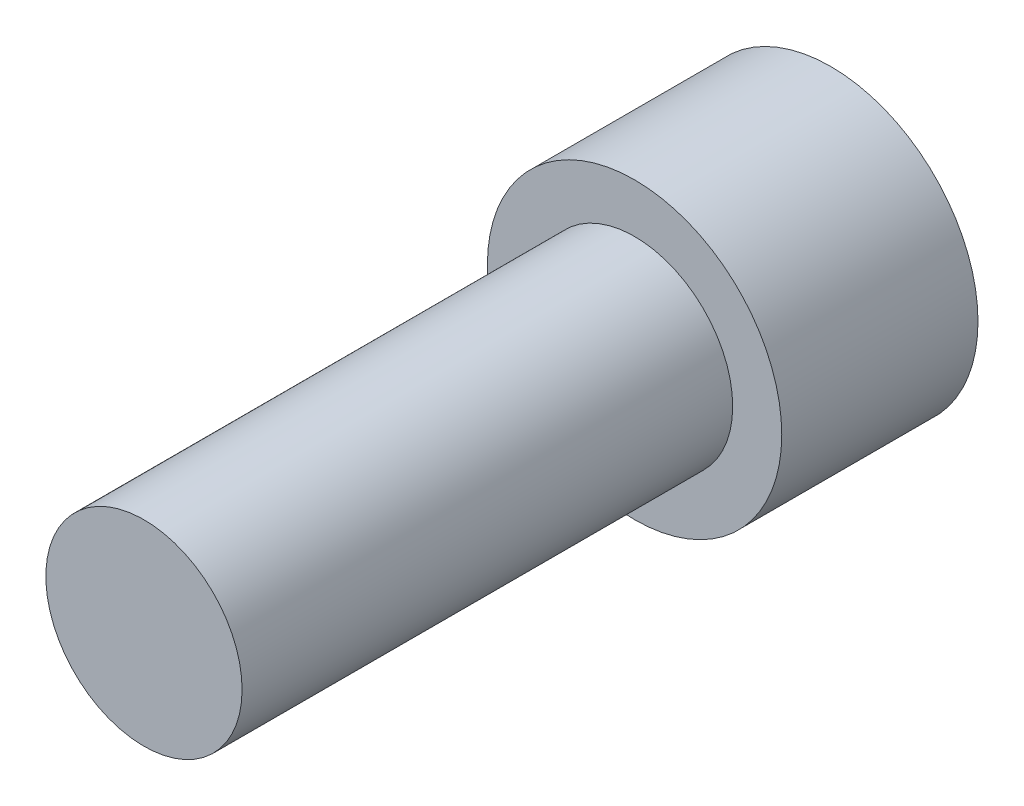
ISO-10303-21;
HEADER;
FILE_DESCRIPTION(('STEP AP214'),'2;1');
FILE_NAME('part.step','',(''),(''),'','','');
FILE_SCHEMA(('AUTOMOTIVE_DESIGN { 1 0 10303 214 1 1 1 1 }'));
ENDSEC;
DATA;
#1=APPLICATION_CONTEXT('core data for automotive mechanical design processes');
#2=APPLICATION_PROTOCOL_DEFINITION('international standard','automotive_design',2000,#1);
#3=PRODUCT_CONTEXT('',#1,'mechanical');
#4=PRODUCT('Part','Part','',(#3));
#5=PRODUCT_RELATED_PRODUCT_CATEGORY('part','',(#4));
#6=PRODUCT_DEFINITION_FORMATION('','',#4);
#7=PRODUCT_DEFINITION_CONTEXT('part definition',#1,'design');
#8=PRODUCT_DEFINITION('design','',#6,#7);
#9=PRODUCT_DEFINITION_SHAPE('','',#8);
#10=(LENGTH_UNIT() NAMED_UNIT(*) SI_UNIT(.MILLI.,.METRE.));
#11=(NAMED_UNIT(*) PLANE_ANGLE_UNIT() SI_UNIT($,.RADIAN.));
#12=(NAMED_UNIT(*) SI_UNIT($,.STERADIAN.) SOLID_ANGLE_UNIT());
#13=UNCERTAINTY_MEASURE_WITH_UNIT(LENGTH_MEASURE(1.E-05),#10,'distance_accuracy_value','');
#14=(GEOMETRIC_REPRESENTATION_CONTEXT(3) GLOBAL_UNCERTAINTY_ASSIGNED_CONTEXT((#13)) GLOBAL_UNIT_ASSIGNED_CONTEXT((#10,
#11,#12)) REPRESENTATION_CONTEXT('',''));
#15=CARTESIAN_POINT('',(0.,0.,0.));
#16=DIRECTION('',(0.,0.,1.));
#17=DIRECTION('',(1.,0.,0.));
#18=AXIS2_PLACEMENT_3D('',#15,#16,#17);
#19=CARTESIAN_POINT('',(0.,-9.525,-12.7));
#20=DIRECTION('',(0.,0.,-1.));
#21=DIRECTION('',(-1.,0.,0.));
#22=AXIS2_PLACEMENT_3D('',#19,#20,#21);
#23=PLANE('',#22);
#24=DIRECTION('',(0.866025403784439,-0.5,0.));
#25=VECTOR('',#24,1.);
#26=CARTESIAN_POINT('',(0.,5.49926131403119,-12.7));
#27=LINE('',#26,#25);
#28=CARTESIAN_POINT('',(0.,5.49926131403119,-12.7));
#29=VERTEX_POINT('',#28);
#30=CARTESIAN_POINT('',(4.7625,2.74963065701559,-12.7));
#31=VERTEX_POINT('',#30);
#32=EDGE_CURVE('E46',#29,#31,#27,.T.);
#33=ORIENTED_EDGE('',*,*,#32,.F.);
#34=DIRECTION('',(0.866025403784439,0.5,0.));
#35=VECTOR('',#34,1.);
#36=CARTESIAN_POINT('',(-4.7625,2.74963065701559,-12.7));
#37=LINE('',#36,#35);
#38=CARTESIAN_POINT('',(-4.7625,2.74963065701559,-12.7));
#39=VERTEX_POINT('',#38);
#40=EDGE_CURVE('E129',#39,#29,#37,.T.);
#41=ORIENTED_EDGE('',*,*,#40,.F.);
#42=DIRECTION('',(0.,1.,0.));
#43=VECTOR('',#42,1.);
#44=CARTESIAN_POINT('',(-4.7625,-2.74963065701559,-12.7));
#45=LINE('',#44,#43);
#46=CARTESIAN_POINT('',(-4.7625,-2.74963065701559,-12.7));
#47=VERTEX_POINT('',#46);
#48=EDGE_CURVE('E127',#47,#39,#45,.T.);
#49=ORIENTED_EDGE('',*,*,#48,.F.);
#50=DIRECTION('',(-0.866025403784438,0.5,0.));
#51=VECTOR('',#50,1.);
#52=CARTESIAN_POINT('',(0.,-5.49926131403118,-12.7));
#53=LINE('',#52,#51);
#54=CARTESIAN_POINT('',(0.,-5.49926131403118,-12.7));
#55=VERTEX_POINT('',#54);
#56=EDGE_CURVE('E94',#55,#47,#53,.T.);
#57=ORIENTED_EDGE('',*,*,#56,.F.);
#58=DIRECTION('',(-0.866025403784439,-0.5,0.));
#59=VECTOR('',#58,1.);
#60=CARTESIAN_POINT('',(4.7625,-2.74963065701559,-12.7));
#61=LINE('',#60,#59);
#62=CARTESIAN_POINT('',(4.7625,-2.74963065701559,-12.7));
#63=VERTEX_POINT('',#62);
#64=EDGE_CURVE('E123',#63,#55,#61,.T.);
#65=ORIENTED_EDGE('',*,*,#64,.F.);
#66=DIRECTION('',(0.,-1.,0.));
#67=VECTOR('',#66,1.);
#68=CARTESIAN_POINT('',(4.7625,2.74963065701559,-12.7));
#69=LINE('',#68,#67);
#70=EDGE_CURVE('E120',#31,#63,#69,.T.);
#71=ORIENTED_EDGE('',*,*,#70,.F.);
#72=EDGE_LOOP('',(#33,#41,#49,#57,#65,#71));
#73=FACE_BOUND('',#72,.T.);
#74=CARTESIAN_POINT('',(0.,0.,-12.7));
#75=DIRECTION('',(0.,0.,1.));
#76=DIRECTION('',(1.,0.,0.));
#77=AXIS2_PLACEMENT_3D('',#74,#75,#76);
#78=CIRCLE('',#77,9.525);
#79=CARTESIAN_POINT('',(9.525,0.,-12.7));
#80=VERTEX_POINT('',#79);
#81=EDGE_CURVE('E11',#80,#80,#78,.T.);
#82=ORIENTED_EDGE('',*,*,#81,.F.);
#83=EDGE_LOOP('',(#82));
#84=FACE_BOUND('',#83,.T.);
#85=ADVANCED_FACE('F32',(#73,#84),#23,.T.);
#86=CARTESIAN_POINT('',(0.,0.,31.75));
#87=DIRECTION('',(0.,0.,1.));
#88=DIRECTION('',(1.,0.,0.));
#89=AXIS2_PLACEMENT_3D('',#86,#87,#88);
#90=CYLINDRICAL_SURFACE('',#89,9.525);
#91=ORIENTED_EDGE('',*,*,#81,.T.);
#92=EDGE_LOOP('',(#91));
#93=FACE_BOUND('',#92,.T.);
#94=CARTESIAN_POINT('',(0.,0.,0.));
#95=DIRECTION('',(0.,0.,1.));
#96=DIRECTION('',(1.,0.,0.));
#97=AXIS2_PLACEMENT_3D('',#94,#95,#96);
#98=CIRCLE('',#97,9.525);
#99=CARTESIAN_POINT('',(9.525,0.,0.));
#100=VERTEX_POINT('',#99);
#101=EDGE_CURVE('E39',#100,#100,#98,.T.);
#102=ORIENTED_EDGE('',*,*,#101,.F.);
#103=EDGE_LOOP('',(#102));
#104=FACE_BOUND('',#103,.T.);
#105=ADVANCED_FACE('F149',(#93,#104),#90,.T.);
#106=CARTESIAN_POINT('',(0.,-6.35,0.));
#107=DIRECTION('',(0.,0.,1.));
#108=DIRECTION('',(1.,0.,0.));
#109=AXIS2_PLACEMENT_3D('',#106,#107,#108);
#110=PLANE('',#109);
#111=ORIENTED_EDGE('',*,*,#101,.T.);
#112=EDGE_LOOP('',(#111));
#113=FACE_BOUND('',#112,.T.);
#114=CARTESIAN_POINT('',(0.,0.,0.));
#115=DIRECTION('',(0.,0.,1.));
#116=DIRECTION('',(1.,0.,0.));
#117=AXIS2_PLACEMENT_3D('',#114,#115,#116);
#118=CIRCLE('',#117,6.35);
#119=CARTESIAN_POINT('',(6.35,0.,0.));
#120=VERTEX_POINT('',#119);
#121=EDGE_CURVE('E141',#120,#120,#118,.T.);
#122=ORIENTED_EDGE('',*,*,#121,.F.);
#123=EDGE_LOOP('',(#122));
#124=FACE_BOUND('',#123,.T.);
#125=ADVANCED_FACE('F146',(#113,#124),#110,.T.);
#126=CARTESIAN_POINT('',(0.,0.,31.75));
#127=DIRECTION('',(0.,0.,1.));
#128=DIRECTION('',(1.,0.,0.));
#129=AXIS2_PLACEMENT_3D('',#126,#127,#128);
#130=CYLINDRICAL_SURFACE('',#129,6.35);
#131=ORIENTED_EDGE('',*,*,#121,.T.);
#132=EDGE_LOOP('',(#131));
#133=FACE_BOUND('',#132,.T.);
#134=CARTESIAN_POINT('',(0.,0.,31.75));
#135=DIRECTION('',(0.,0.,1.));
#136=DIRECTION('',(1.,0.,0.));
#137=AXIS2_PLACEMENT_3D('',#134,#135,#136);
#138=CIRCLE('',#137,6.35);
#139=CARTESIAN_POINT('',(6.35,0.,31.75));
#140=VERTEX_POINT('',#139);
#141=EDGE_CURVE('E133',#140,#140,#138,.T.);
#142=ORIENTED_EDGE('',*,*,#141,.F.);
#143=EDGE_LOOP('',(#142));
#144=FACE_BOUND('',#143,.T.);
#145=ADVANCED_FACE('F156',(#133,#144),#130,.T.);
#146=CARTESIAN_POINT('',(0.,0.,31.75));
#147=DIRECTION('',(0.,0.,1.));
#148=DIRECTION('',(1.,0.,0.));
#149=AXIS2_PLACEMENT_3D('',#146,#147,#148);
#150=PLANE('',#149);
#151=ORIENTED_EDGE('',*,*,#141,.T.);
#152=EDGE_LOOP('',(#151));
#153=FACE_BOUND('',#152,.T.);
#154=ADVANCED_FACE('F162',(#153),#150,.T.);
#155=CARTESIAN_POINT('',(0.,5.49926131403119,-5.588));
#156=DIRECTION('',(0.5,0.866025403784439,0.));
#157=DIRECTION('',(-0.866025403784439,0.5,0.));
#158=AXIS2_PLACEMENT_3D('',#155,#156,#157);
#159=PLANE('',#158);
#160=ORIENTED_EDGE('',*,*,#32,.T.);
#161=DIRECTION('',(0.,0.,-1.));
#162=VECTOR('',#161,1.);
#163=CARTESIAN_POINT('',(4.7625,2.74963065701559,-5.588));
#164=LINE('',#163,#162);
#165=CARTESIAN_POINT('',(4.7625,2.74963065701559,-5.588));
#166=VERTEX_POINT('',#165);
#167=EDGE_CURVE('E76',#166,#31,#164,.T.);
#168=ORIENTED_EDGE('',*,*,#167,.F.);
#169=DIRECTION('',(0.866025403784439,-0.5,0.));
#170=VECTOR('',#169,1.);
#171=CARTESIAN_POINT('',(0.,5.49926131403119,-5.588));
#172=LINE('',#171,#170);
#173=CARTESIAN_POINT('',(0.,5.49926131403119,-5.588));
#174=VERTEX_POINT('',#173);
#175=EDGE_CURVE('E131',#174,#166,#172,.T.);
#176=ORIENTED_EDGE('',*,*,#175,.F.);
#177=DIRECTION('',(0.,0.,-1.));
#178=VECTOR('',#177,1.);
#179=CARTESIAN_POINT('',(0.,5.49926131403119,-5.588));
#180=LINE('',#179,#178);
#181=EDGE_CURVE('E54',#174,#29,#180,.T.);
#182=ORIENTED_EDGE('',*,*,#181,.T.);
#183=EDGE_LOOP('',(#160,#168,#176,#182));
#184=FACE_BOUND('',#183,.T.);
#185=ADVANCED_FACE('F166',(#184),#159,.F.);
#186=CARTESIAN_POINT('',(-4.7625,2.74963065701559,-5.588));
#187=DIRECTION('',(-0.5,0.866025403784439,0.));
#188=DIRECTION('',(-0.866025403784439,-0.5,0.));
#189=AXIS2_PLACEMENT_3D('',#186,#187,#188);
#190=PLANE('',#189);
#191=ORIENTED_EDGE('',*,*,#40,.T.);
#192=ORIENTED_EDGE('',*,*,#181,.F.);
#193=DIRECTION('',(0.866025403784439,0.5,0.));
#194=VECTOR('',#193,1.);
#195=CARTESIAN_POINT('',(-4.7625,2.74963065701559,-5.588));
#196=LINE('',#195,#194);
#197=CARTESIAN_POINT('',(-4.7625,2.74963065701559,-5.588));
#198=VERTEX_POINT('',#197);
#199=EDGE_CURVE('E106',#198,#174,#196,.T.);
#200=ORIENTED_EDGE('',*,*,#199,.F.);
#201=DIRECTION('',(0.,0.,-1.));
#202=VECTOR('',#201,1.);
#203=CARTESIAN_POINT('',(-4.7625,2.74963065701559,-5.588));
#204=LINE('',#203,#202);
#205=EDGE_CURVE('E98',#198,#39,#204,.T.);
#206=ORIENTED_EDGE('',*,*,#205,.T.);
#207=EDGE_LOOP('',(#191,#192,#200,#206));
#208=FACE_BOUND('',#207,.T.);
#209=ADVANCED_FACE('F170',(#208),#190,.F.);
#210=CARTESIAN_POINT('',(-4.7625,-2.74963065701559,-5.588));
#211=DIRECTION('',(-1.,0.,0.));
#212=DIRECTION('',(0.,-1.,0.));
#213=AXIS2_PLACEMENT_3D('',#210,#211,#212);
#214=PLANE('',#213);
#215=ORIENTED_EDGE('',*,*,#48,.T.);
#216=ORIENTED_EDGE('',*,*,#205,.F.);
#217=DIRECTION('',(0.,1.,0.));
#218=VECTOR('',#217,1.);
#219=CARTESIAN_POINT('',(-4.7625,-2.74963065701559,-5.588));
#220=LINE('',#219,#218);
#221=CARTESIAN_POINT('',(-4.7625,-2.74963065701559,-5.588));
#222=VERTEX_POINT('',#221);
#223=EDGE_CURVE('E102',#222,#198,#220,.T.);
#224=ORIENTED_EDGE('',*,*,#223,.F.);
#225=DIRECTION('',(0.,0.,-1.));
#226=VECTOR('',#225,1.);
#227=CARTESIAN_POINT('',(-4.7625,-2.74963065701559,-5.588));
#228=LINE('',#227,#226);
#229=EDGE_CURVE('E87',#222,#47,#228,.T.);
#230=ORIENTED_EDGE('',*,*,#229,.T.);
#231=EDGE_LOOP('',(#215,#216,#224,#230));
#232=FACE_BOUND('',#231,.T.);
#233=ADVANCED_FACE('F103',(#232),#214,.F.);
#234=CARTESIAN_POINT('',(0.,-5.49926131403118,-5.588));
#235=DIRECTION('',(-0.5,-0.866025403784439,0.));
#236=DIRECTION('',(0.866025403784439,-0.5,0.));
#237=AXIS2_PLACEMENT_3D('',#234,#235,#236);
#238=PLANE('',#237);
#239=ORIENTED_EDGE('',*,*,#56,.T.);
#240=ORIENTED_EDGE('',*,*,#229,.F.);
#241=DIRECTION('',(-0.866025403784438,0.5,0.));
#242=VECTOR('',#241,1.);
#243=CARTESIAN_POINT('',(0.,-5.49926131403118,-5.588));
#244=LINE('',#243,#242);
#245=CARTESIAN_POINT('',(0.,-5.49926131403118,-5.588));
#246=VERTEX_POINT('',#245);
#247=EDGE_CURVE('E91',#246,#222,#244,.T.);
#248=ORIENTED_EDGE('',*,*,#247,.F.);
#249=DIRECTION('',(0.,0.,-1.));
#250=VECTOR('',#249,1.);
#251=CARTESIAN_POINT('',(0.,-5.49926131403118,-5.588));
#252=LINE('',#251,#250);
#253=EDGE_CURVE('E99',#246,#55,#252,.T.);
#254=ORIENTED_EDGE('',*,*,#253,.T.);
#255=EDGE_LOOP('',(#239,#240,#248,#254));
#256=FACE_BOUND('',#255,.T.);
#257=ADVANCED_FACE('F89',(#256),#238,.F.);
#258=CARTESIAN_POINT('',(4.7625,-2.74963065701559,-5.588));
#259=DIRECTION('',(0.5,-0.866025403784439,0.));
#260=DIRECTION('',(0.866025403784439,0.5,0.));
#261=AXIS2_PLACEMENT_3D('',#258,#259,#260);
#262=PLANE('',#261);
#263=ORIENTED_EDGE('',*,*,#64,.T.);
#264=ORIENTED_EDGE('',*,*,#253,.F.);
#265=DIRECTION('',(-0.866025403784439,-0.5,0.));
#266=VECTOR('',#265,1.);
#267=CARTESIAN_POINT('',(4.7625,-2.74963065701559,-5.588));
#268=LINE('',#267,#266);
#269=CARTESIAN_POINT('',(4.7625,-2.74963065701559,-5.588));
#270=VERTEX_POINT('',#269);
#271=EDGE_CURVE('E112',#270,#246,#268,.T.);
#272=ORIENTED_EDGE('',*,*,#271,.F.);
#273=DIRECTION('',(0.,0.,-1.));
#274=VECTOR('',#273,1.);
#275=CARTESIAN_POINT('',(4.7625,-2.74963065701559,-5.588));
#276=LINE('',#275,#274);
#277=EDGE_CURVE('E136',#270,#63,#276,.T.);
#278=ORIENTED_EDGE('',*,*,#277,.T.);
#279=EDGE_LOOP('',(#263,#264,#272,#278));
#280=FACE_BOUND('',#279,.T.);
#281=ADVANCED_FACE('F174',(#280),#262,.F.);
#282=CARTESIAN_POINT('',(4.7625,2.74963065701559,-5.588));
#283=DIRECTION('',(1.,0.,0.));
#284=DIRECTION('',(0.,0.,-1.));
#285=AXIS2_PLACEMENT_3D('',#282,#283,#284);
#286=PLANE('',#285);
#287=ORIENTED_EDGE('',*,*,#70,.T.);
#288=ORIENTED_EDGE('',*,*,#277,.F.);
#289=DIRECTION('',(0.,-1.,0.));
#290=VECTOR('',#289,1.);
#291=CARTESIAN_POINT('',(4.7625,2.74963065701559,-5.588));
#292=LINE('',#291,#290);
#293=EDGE_CURVE('E114',#166,#270,#292,.T.);
#294=ORIENTED_EDGE('',*,*,#293,.F.);
#295=ORIENTED_EDGE('',*,*,#167,.T.);
#296=EDGE_LOOP('',(#287,#288,#294,#295));
#297=FACE_BOUND('',#296,.T.);
#298=ADVANCED_FACE('F171',(#297),#286,.F.);
#299=CARTESIAN_POINT('',(9.525,0.,-5.588));
#300=DIRECTION('',(0.,0.,-1.));
#301=DIRECTION('',(-1.,0.,0.));
#302=AXIS2_PLACEMENT_3D('',#299,#300,#301);
#303=PLANE('',#302);
#304=ORIENTED_EDGE('',*,*,#175,.T.);
#305=ORIENTED_EDGE('',*,*,#293,.T.);
#306=ORIENTED_EDGE('',*,*,#271,.T.);
#307=ORIENTED_EDGE('',*,*,#247,.T.);
#308=ORIENTED_EDGE('',*,*,#223,.T.);
#309=ORIENTED_EDGE('',*,*,#199,.T.);
#310=EDGE_LOOP('',(#304,#305,#306,#307,#308,#309));
#311=FACE_BOUND('',#310,.T.);
#312=ADVANCED_FACE('F109',(#311),#303,.T.);
#313=CLOSED_SHELL('',(#85,#105,#125,#145,#154,#185,#209,#233,#257,#281,#298,#312));
#314=MANIFOLD_SOLID_BREP('B2',#313);
#315=ADVANCED_BREP_SHAPE_REPRESENTATION('',(#18,#314),#14);
#316=SHAPE_DEFINITION_REPRESENTATION(#9,#315);
ENDSEC;
END-ISO-10303-21;
